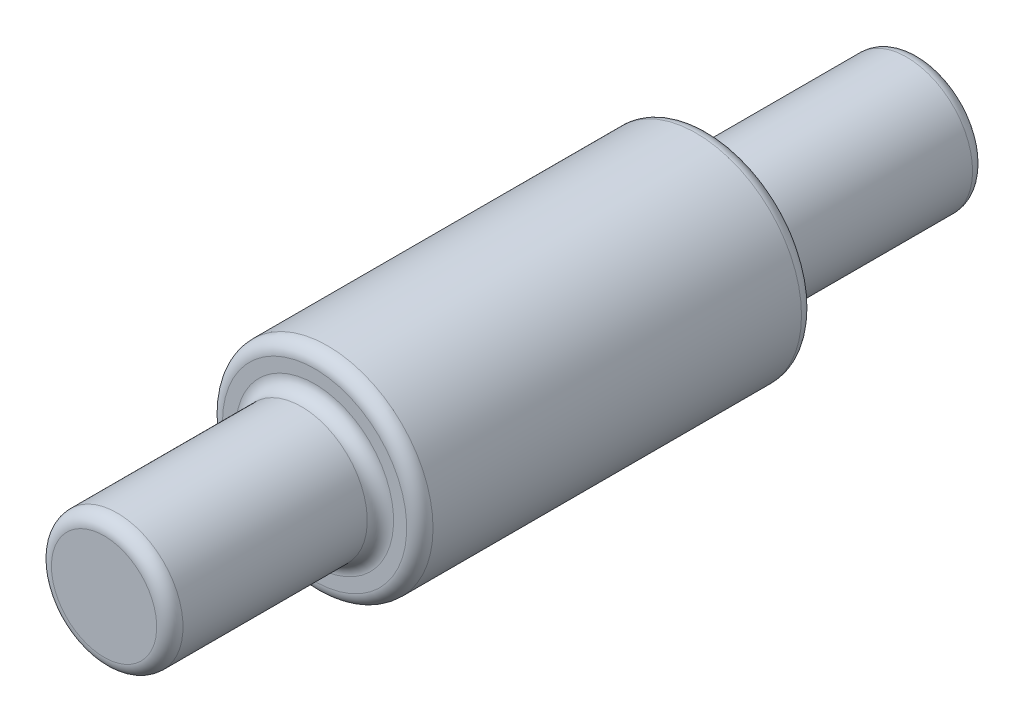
ISO-10303-21;
HEADER;
FILE_DESCRIPTION(('STEP AP214'),'2;1');
FILE_NAME('part.step','',(''),(''),'','','');
FILE_SCHEMA(('AUTOMOTIVE_DESIGN { 1 0 10303 214 1 1 1 1 }'));
ENDSEC;
DATA;
#1=APPLICATION_CONTEXT('core data for automotive mechanical design processes');
#2=APPLICATION_PROTOCOL_DEFINITION('international standard','automotive_design',2000,#1);
#3=PRODUCT_CONTEXT('',#1,'mechanical');
#4=PRODUCT('Part','Part','',(#3));
#5=PRODUCT_RELATED_PRODUCT_CATEGORY('part','',(#4));
#6=PRODUCT_DEFINITION_FORMATION('','',#4);
#7=PRODUCT_DEFINITION_CONTEXT('part definition',#1,'design');
#8=PRODUCT_DEFINITION('design','',#6,#7);
#9=PRODUCT_DEFINITION_SHAPE('','',#8);
#10=(LENGTH_UNIT() NAMED_UNIT(*) SI_UNIT(.MILLI.,.METRE.));
#11=(NAMED_UNIT(*) PLANE_ANGLE_UNIT() SI_UNIT($,.RADIAN.));
#12=(NAMED_UNIT(*) SI_UNIT($,.STERADIAN.) SOLID_ANGLE_UNIT());
#13=UNCERTAINTY_MEASURE_WITH_UNIT(LENGTH_MEASURE(1.E-05),#10,'distance_accuracy_value','');
#14=(GEOMETRIC_REPRESENTATION_CONTEXT(3) GLOBAL_UNCERTAINTY_ASSIGNED_CONTEXT((#13)) GLOBAL_UNIT_ASSIGNED_CONTEXT((#10,
#11,#12)) REPRESENTATION_CONTEXT('',''));
#15=CARTESIAN_POINT('',(0.,0.,0.));
#16=DIRECTION('',(0.,0.,1.));
#17=DIRECTION('',(1.,0.,0.));
#18=AXIS2_PLACEMENT_3D('',#15,#16,#17);
#19=CARTESIAN_POINT('',(0.,2.5,15.5));
#20=DIRECTION('',(0.,0.,-1.));
#21=DIRECTION('',(-1.,0.,0.));
#22=AXIS2_PLACEMENT_3D('',#19,#20,#21);
#23=PLANE('',#22);
#24=CARTESIAN_POINT('',(0.,0.,15.5));
#25=DIRECTION('',(0.,0.,-1.));
#26=DIRECTION('',(-1.,0.,0.));
#27=AXIS2_PLACEMENT_3D('',#24,#25,#26);
#28=CIRCLE('',#27,2.);
#29=CARTESIAN_POINT('',(-2.,0.,15.5));
#30=VERTEX_POINT('',#29);
#31=EDGE_CURVE('E40',#30,#30,#28,.F.);
#32=ORIENTED_EDGE('',*,*,#31,.T.);
#33=EDGE_LOOP('',(#32));
#34=FACE_BOUND('',#33,.T.);
#35=ADVANCED_FACE('F29',(#34),#23,.F.);
#36=CARTESIAN_POINT('',(0.,0.,-15.5));
#37=DIRECTION('',(0.,0.,1.));
#38=DIRECTION('',(1.,0.,0.));
#39=AXIS2_PLACEMENT_3D('',#36,#37,#38);
#40=PLANE('',#39);
#41=CARTESIAN_POINT('',(0.,0.,-15.5));
#42=DIRECTION('',(0.,0.,1.));
#43=DIRECTION('',(1.,0.,0.));
#44=AXIS2_PLACEMENT_3D('',#41,#42,#43);
#45=CIRCLE('',#44,2.);
#46=CARTESIAN_POINT('',(2.,0.,-15.5));
#47=VERTEX_POINT('',#46);
#48=EDGE_CURVE('E64',#47,#47,#45,.F.);
#49=ORIENTED_EDGE('',*,*,#48,.T.);
#50=EDGE_LOOP('',(#49));
#51=FACE_BOUND('',#50,.T.);
#52=ADVANCED_FACE('F103',(#51),#40,.F.);
#53=CARTESIAN_POINT('',(0.,0.,15.5));
#54=DIRECTION('',(0.,0.,1.));
#55=DIRECTION('',(1.,0.,0.));
#56=AXIS2_PLACEMENT_3D('',#53,#54,#55);
#57=CYLINDRICAL_SURFACE('',#56,2.5);
#58=CARTESIAN_POINT('',(0.,0.,-15.));
#59=DIRECTION('',(0.,0.,1.));
#60=DIRECTION('',(1.,0.,0.));
#61=AXIS2_PLACEMENT_3D('',#58,#59,#60);
#62=CIRCLE('',#61,2.5);
#63=CARTESIAN_POINT('',(2.5,0.,-15.));
#64=VERTEX_POINT('',#63);
#65=EDGE_CURVE('E67',#64,#64,#62,.T.);
#66=ORIENTED_EDGE('',*,*,#65,.T.);
#67=EDGE_LOOP('',(#66));
#68=FACE_BOUND('',#67,.T.);
#69=CARTESIAN_POINT('',(0.,0.,-8.));
#70=DIRECTION('',(0.,0.,1.));
#71=DIRECTION('',(1.,0.,0.));
#72=AXIS2_PLACEMENT_3D('',#69,#70,#71);
#73=CIRCLE('',#72,2.5);
#74=CARTESIAN_POINT('',(2.5,0.,-8.));
#75=VERTEX_POINT('',#74);
#76=EDGE_CURVE('E70',#75,#75,#73,.F.);
#77=ORIENTED_EDGE('',*,*,#76,.T.);
#78=EDGE_LOOP('',(#77));
#79=FACE_BOUND('',#78,.T.);
#80=ADVANCED_FACE('F74',(#68,#79),#57,.T.);
#81=CARTESIAN_POINT('',(0.,2.5,-7.5));
#82=DIRECTION('',(0.,0.,1.));
#83=DIRECTION('',(1.,0.,0.));
#84=AXIS2_PLACEMENT_3D('',#81,#82,#83);
#85=PLANE('',#84);
#86=CARTESIAN_POINT('',(0.,0.,-7.5));
#87=DIRECTION('',(0.,0.,1.));
#88=DIRECTION('',(1.,0.,0.));
#89=AXIS2_PLACEMENT_3D('',#86,#87,#88);
#90=CIRCLE('',#89,3.);
#91=CARTESIAN_POINT('',(3.,0.,-7.5));
#92=VERTEX_POINT('',#91);
#93=EDGE_CURVE('E58',#92,#92,#90,.T.);
#94=ORIENTED_EDGE('',*,*,#93,.T.);
#95=EDGE_LOOP('',(#94));
#96=FACE_BOUND('',#95,.T.);
#97=CARTESIAN_POINT('',(0.,0.,-7.5));
#98=DIRECTION('',(0.,0.,1.));
#99=DIRECTION('',(1.,0.,0.));
#100=AXIS2_PLACEMENT_3D('',#97,#98,#99);
#101=CIRCLE('',#100,3.5);
#102=CARTESIAN_POINT('',(3.5,0.,-7.5));
#103=VERTEX_POINT('',#102);
#104=EDGE_CURVE('E61',#103,#103,#101,.F.);
#105=ORIENTED_EDGE('',*,*,#104,.T.);
#106=EDGE_LOOP('',(#105));
#107=FACE_BOUND('',#106,.T.);
#108=ADVANCED_FACE('F84',(#96,#107),#85,.F.);
#109=CARTESIAN_POINT('',(0.,0.,15.5));
#110=DIRECTION('',(0.,0.,1.));
#111=DIRECTION('',(1.,0.,0.));
#112=AXIS2_PLACEMENT_3D('',#109,#110,#111);
#113=CYLINDRICAL_SURFACE('',#112,4.);
#114=CARTESIAN_POINT('',(0.,0.,-7.));
#115=DIRECTION('',(0.,0.,1.));
#116=DIRECTION('',(1.,0.,0.));
#117=AXIS2_PLACEMENT_3D('',#114,#115,#116);
#118=CIRCLE('',#117,4.);
#119=CARTESIAN_POINT('',(4.,0.,-7.));
#120=VERTEX_POINT('',#119);
#121=EDGE_CURVE('E10',#120,#120,#118,.T.);
#122=ORIENTED_EDGE('',*,*,#121,.T.);
#123=EDGE_LOOP('',(#122));
#124=FACE_BOUND('',#123,.T.);
#125=CARTESIAN_POINT('',(0.,0.,7.));
#126=DIRECTION('',(0.,0.,-1.));
#127=DIRECTION('',(-1.,0.,0.));
#128=AXIS2_PLACEMENT_3D('',#125,#126,#127);
#129=CIRCLE('',#128,4.);
#130=CARTESIAN_POINT('',(-4.,0.,7.));
#131=VERTEX_POINT('',#130);
#132=EDGE_CURVE('E36',#131,#131,#129,.T.);
#133=ORIENTED_EDGE('',*,*,#132,.T.);
#134=EDGE_LOOP('',(#133));
#135=FACE_BOUND('',#134,.T.);
#136=ADVANCED_FACE('F87',(#124,#135),#113,.T.);
#137=CARTESIAN_POINT('',(0.,4.,7.5));
#138=DIRECTION('',(0.,0.,-1.));
#139=DIRECTION('',(-1.,0.,0.));
#140=AXIS2_PLACEMENT_3D('',#137,#138,#139);
#141=PLANE('',#140);
#142=CARTESIAN_POINT('',(0.,0.,7.5));
#143=DIRECTION('',(0.,0.,-1.));
#144=DIRECTION('',(-1.,0.,0.));
#145=AXIS2_PLACEMENT_3D('',#142,#143,#144);
#146=CIRCLE('',#145,3.);
#147=CARTESIAN_POINT('',(-3.,0.,7.5));
#148=VERTEX_POINT('',#147);
#149=EDGE_CURVE('E44',#148,#148,#146,.T.);
#150=ORIENTED_EDGE('',*,*,#149,.T.);
#151=EDGE_LOOP('',(#150));
#152=FACE_BOUND('',#151,.T.);
#153=CARTESIAN_POINT('',(0.,0.,7.5));
#154=DIRECTION('',(0.,0.,-1.));
#155=DIRECTION('',(-1.,0.,0.));
#156=AXIS2_PLACEMENT_3D('',#153,#154,#155);
#157=CIRCLE('',#156,3.5);
#158=CARTESIAN_POINT('',(-3.5,0.,7.5));
#159=VERTEX_POINT('',#158);
#160=EDGE_CURVE('E49',#159,#159,#157,.F.);
#161=ORIENTED_EDGE('',*,*,#160,.T.);
#162=EDGE_LOOP('',(#161));
#163=FACE_BOUND('',#162,.T.);
#164=ADVANCED_FACE('F127',(#152,#163),#141,.F.);
#165=CARTESIAN_POINT('',(0.,0.,15.5));
#166=DIRECTION('',(0.,0.,1.));
#167=DIRECTION('',(1.,0.,0.));
#168=AXIS2_PLACEMENT_3D('',#165,#166,#167);
#169=CYLINDRICAL_SURFACE('',#168,2.5);
#170=CARTESIAN_POINT('',(0.,0.,8.));
#171=DIRECTION('',(0.,0.,-1.));
#172=DIRECTION('',(-1.,0.,0.));
#173=AXIS2_PLACEMENT_3D('',#170,#171,#172);
#174=CIRCLE('',#173,2.5);
#175=CARTESIAN_POINT('',(-2.5,0.,8.));
#176=VERTEX_POINT('',#175);
#177=EDGE_CURVE('E52',#176,#176,#174,.F.);
#178=ORIENTED_EDGE('',*,*,#177,.T.);
#179=EDGE_LOOP('',(#178));
#180=FACE_BOUND('',#179,.T.);
#181=CARTESIAN_POINT('',(0.,0.,15.));
#182=DIRECTION('',(0.,0.,-1.));
#183=DIRECTION('',(-1.,0.,0.));
#184=AXIS2_PLACEMENT_3D('',#181,#182,#183);
#185=CIRCLE('',#184,2.5);
#186=CARTESIAN_POINT('',(-2.5,0.,15.));
#187=VERTEX_POINT('',#186);
#188=EDGE_CURVE('E55',#187,#187,#185,.T.);
#189=ORIENTED_EDGE('',*,*,#188,.T.);
#190=EDGE_LOOP('',(#189));
#191=FACE_BOUND('',#190,.T.);
#192=ADVANCED_FACE('F114',(#180,#191),#169,.T.);
#193=CARTESIAN_POINT('',(0.,0.,-15.));
#194=DIRECTION('',(0.,0.,1.));
#195=DIRECTION('',(1.,0.,0.));
#196=AXIS2_PLACEMENT_3D('',#193,#194,#195);
#197=TOROIDAL_SURFACE('',#196,2.,0.5);
#198=ORIENTED_EDGE('',*,*,#48,.F.);
#199=EDGE_LOOP('',(#198));
#200=FACE_BOUND('',#199,.T.);
#201=ORIENTED_EDGE('',*,*,#65,.F.);
#202=EDGE_LOOP('',(#201));
#203=FACE_BOUND('',#202,.T.);
#204=ADVANCED_FACE('F80',(#200,#203),#197,.T.);
#205=CARTESIAN_POINT('',(0.,0.,-8.));
#206=DIRECTION('',(0.,0.,1.));
#207=DIRECTION('',(1.,0.,0.));
#208=AXIS2_PLACEMENT_3D('',#205,#206,#207);
#209=TOROIDAL_SURFACE('',#208,3.,0.5);
#210=ORIENTED_EDGE('',*,*,#76,.F.);
#211=EDGE_LOOP('',(#210));
#212=FACE_BOUND('',#211,.T.);
#213=ORIENTED_EDGE('',*,*,#93,.F.);
#214=EDGE_LOOP('',(#213));
#215=FACE_BOUND('',#214,.T.);
#216=ADVANCED_FACE('F76',(#212,#215),#209,.F.);
#217=CARTESIAN_POINT('',(0.,0.,8.));
#218=DIRECTION('',(0.,0.,-1.));
#219=DIRECTION('',(-1.,0.,0.));
#220=AXIS2_PLACEMENT_3D('',#217,#218,#219);
#221=TOROIDAL_SURFACE('',#220,3.,0.5);
#222=ORIENTED_EDGE('',*,*,#149,.F.);
#223=EDGE_LOOP('',(#222));
#224=FACE_BOUND('',#223,.T.);
#225=ORIENTED_EDGE('',*,*,#177,.F.);
#226=EDGE_LOOP('',(#225));
#227=FACE_BOUND('',#226,.T.);
#228=ADVANCED_FACE('F79',(#224,#227),#221,.F.);
#229=CARTESIAN_POINT('',(0.,0.,15.));
#230=DIRECTION('',(0.,0.,-1.));
#231=DIRECTION('',(-1.,0.,0.));
#232=AXIS2_PLACEMENT_3D('',#229,#230,#231);
#233=TOROIDAL_SURFACE('',#232,2.,0.5);
#234=ORIENTED_EDGE('',*,*,#188,.F.);
#235=EDGE_LOOP('',(#234));
#236=FACE_BOUND('',#235,.T.);
#237=ORIENTED_EDGE('',*,*,#31,.F.);
#238=EDGE_LOOP('',(#237));
#239=FACE_BOUND('',#238,.T.);
#240=ADVANCED_FACE('F94',(#236,#239),#233,.T.);
#241=CARTESIAN_POINT('',(0.,0.,-7.));
#242=DIRECTION('',(0.,0.,1.));
#243=DIRECTION('',(1.,0.,0.));
#244=AXIS2_PLACEMENT_3D('',#241,#242,#243);
#245=TOROIDAL_SURFACE('',#244,3.5,0.5);
#246=ORIENTED_EDGE('',*,*,#104,.F.);
#247=EDGE_LOOP('',(#246));
#248=FACE_BOUND('',#247,.T.);
#249=ORIENTED_EDGE('',*,*,#121,.F.);
#250=EDGE_LOOP('',(#249));
#251=FACE_BOUND('',#250,.T.);
#252=ADVANCED_FACE('F91',(#248,#251),#245,.T.);
#253=CARTESIAN_POINT('',(0.,0.,7.));
#254=DIRECTION('',(0.,0.,-1.));
#255=DIRECTION('',(-1.,0.,0.));
#256=AXIS2_PLACEMENT_3D('',#253,#254,#255);
#257=TOROIDAL_SURFACE('',#256,3.5,0.5);
#258=ORIENTED_EDGE('',*,*,#132,.F.);
#259=EDGE_LOOP('',(#258));
#260=FACE_BOUND('',#259,.T.);
#261=ORIENTED_EDGE('',*,*,#160,.F.);
#262=EDGE_LOOP('',(#261));
#263=FACE_BOUND('',#262,.T.);
#264=ADVANCED_FACE('F31',(#260,#263),#257,.T.);
#265=CLOSED_SHELL('',(#35,#52,#80,#108,#136,#164,#192,#204,#216,#228,#240,#252,#264));
#266=MANIFOLD_SOLID_BREP('B2',#265);
#267=ADVANCED_BREP_SHAPE_REPRESENTATION('',(#18,#266),#14);
#268=SHAPE_DEFINITION_REPRESENTATION(#9,#267);
ENDSEC;
END-ISO-10303-21;
